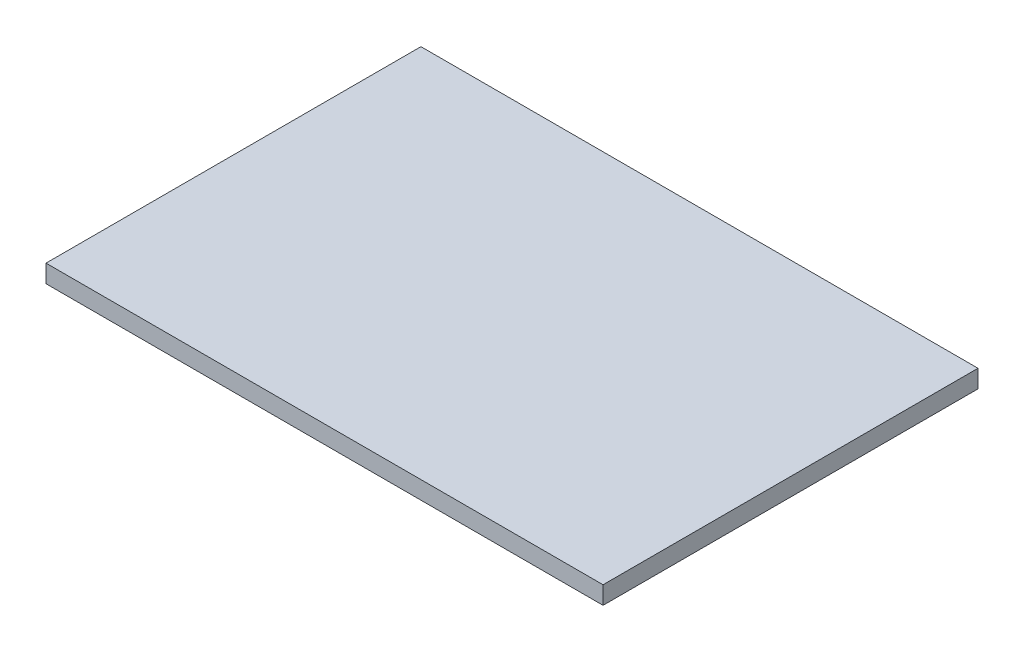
from build123d import *

# Parameters (mm, degrees)
ESQUISSE1_W        = 312
ESQUISSE1_H        = 10
BOSS_EXTRU_1_DEPTH = 210


with BuildPart() as part:
    # Esquisse1 → Boss.-Extru.1 (new body)
    with BuildSketch(Plane.XY):
        with Locations((49.844665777, 44.19972067)):
            Rectangle(ESQUISSE1_W, ESQUISSE1_H)
    extrude(amount=BOSS_EXTRU_1_DEPTH)


solid = part.part
